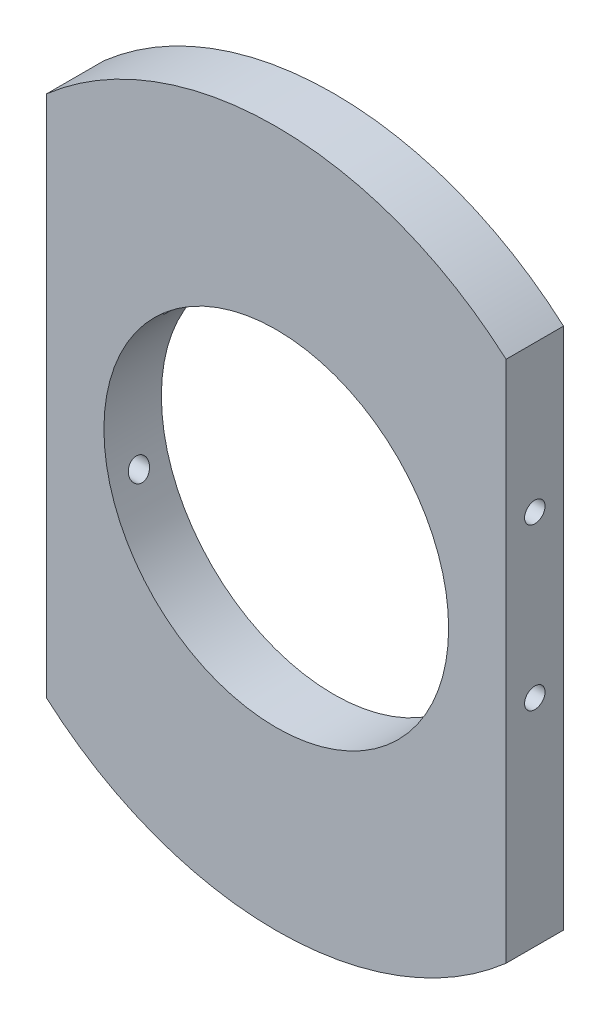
ISO-10303-21;
HEADER;
FILE_DESCRIPTION(('STEP AP214'),'2;1');
FILE_NAME('part.step','',(''),(''),'','','');
FILE_SCHEMA(('AUTOMOTIVE_DESIGN { 1 0 10303 214 1 1 1 1 }'));
ENDSEC;
DATA;
#1=APPLICATION_CONTEXT('core data for automotive mechanical design processes');
#2=APPLICATION_PROTOCOL_DEFINITION('international standard','automotive_design',2000,#1);
#3=PRODUCT_CONTEXT('',#1,'mechanical');
#4=PRODUCT('Part','Part','',(#3));
#5=PRODUCT_RELATED_PRODUCT_CATEGORY('part','',(#4));
#6=PRODUCT_DEFINITION_FORMATION('','',#4);
#7=PRODUCT_DEFINITION_CONTEXT('part definition',#1,'design');
#8=PRODUCT_DEFINITION('design','',#6,#7);
#9=PRODUCT_DEFINITION_SHAPE('','',#8);
#10=(LENGTH_UNIT() NAMED_UNIT(*) SI_UNIT(.MILLI.,.METRE.));
#11=(NAMED_UNIT(*) PLANE_ANGLE_UNIT() SI_UNIT($,.RADIAN.));
#12=(NAMED_UNIT(*) SI_UNIT($,.STERADIAN.) SOLID_ANGLE_UNIT());
#13=UNCERTAINTY_MEASURE_WITH_UNIT(LENGTH_MEASURE(1.E-05),#10,'distance_accuracy_value','');
#14=(GEOMETRIC_REPRESENTATION_CONTEXT(3) GLOBAL_UNCERTAINTY_ASSIGNED_CONTEXT((#13)) GLOBAL_UNIT_ASSIGNED_CONTEXT((#10,
#11,#12)) REPRESENTATION_CONTEXT('',''));
#15=CARTESIAN_POINT('',(0.,0.,0.));
#16=DIRECTION('',(0.,0.,1.));
#17=DIRECTION('',(1.,0.,0.));
#18=AXIS2_PLACEMENT_3D('',#15,#16,#17);
#19=CARTESIAN_POINT('',(0.,0.,6.35));
#20=DIRECTION('',(0.,0.,-1.));
#21=DIRECTION('',(-1.,0.,0.));
#22=AXIS2_PLACEMENT_3D('',#19,#20,#21);
#23=CYLINDRICAL_SURFACE('',#22,38.481);
#24=DIRECTION('',(0.,0.,-1.));
#25=VECTOR('',#24,1.);
#26=CARTESIAN_POINT('',(-25.4,28.9072198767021,6.35));
#27=LINE('',#26,#25);
#28=CARTESIAN_POINT('',(-25.4,28.9072198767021,6.35));
#29=VERTEX_POINT('',#28);
#30=CARTESIAN_POINT('',(-25.4,28.9072198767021,0.));
#31=VERTEX_POINT('',#30);
#32=EDGE_CURVE('E135',#29,#31,#27,.T.);
#33=ORIENTED_EDGE('',*,*,#32,.F.);
#34=CARTESIAN_POINT('',(0.,0.,6.35));
#35=DIRECTION('',(0.,0.,1.));
#36=DIRECTION('',(1.,0.,0.));
#37=AXIS2_PLACEMENT_3D('',#34,#35,#36);
#38=CIRCLE('',#37,38.481);
#39=CARTESIAN_POINT('',(25.4,28.9072198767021,6.35));
#40=VERTEX_POINT('',#39);
#41=EDGE_CURVE('E142',#40,#29,#38,.T.);
#42=ORIENTED_EDGE('',*,*,#41,.F.);
#43=DIRECTION('',(0.,0.,-1.));
#44=VECTOR('',#43,1.);
#45=CARTESIAN_POINT('',(25.4,28.9072198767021,6.35));
#46=LINE('',#45,#44);
#47=CARTESIAN_POINT('',(25.4,28.9072198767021,0.));
#48=VERTEX_POINT('',#47);
#49=EDGE_CURVE('E210',#48,#40,#46,.F.);
#50=ORIENTED_EDGE('',*,*,#49,.F.);
#51=CARTESIAN_POINT('',(0.,0.,0.));
#52=DIRECTION('',(0.,0.,1.));
#53=DIRECTION('',(1.,0.,0.));
#54=AXIS2_PLACEMENT_3D('',#51,#52,#53);
#55=CIRCLE('',#54,38.481);
#56=EDGE_CURVE('E147',#48,#31,#55,.T.);
#57=ORIENTED_EDGE('',*,*,#56,.T.);
#58=EDGE_LOOP('',(#33,#42,#50,#57));
#59=FACE_BOUND('',#58,.T.);
#60=ADVANCED_FACE('F46',(#59),#23,.T.);
#61=DIRECTION('',(0.,0.,-1.));
#62=VECTOR('',#61,1.);
#63=CARTESIAN_POINT('',(-25.4,-28.9072198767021,6.35));
#64=LINE('',#63,#62);
#65=CARTESIAN_POINT('',(-25.4,-28.9072198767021,0.));
#66=VERTEX_POINT('',#65);
#67=CARTESIAN_POINT('',(-25.4,-28.9072198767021,6.35));
#68=VERTEX_POINT('',#67);
#69=EDGE_CURVE('E139',#66,#68,#64,.F.);
#70=ORIENTED_EDGE('',*,*,#69,.F.);
#71=CARTESIAN_POINT('',(25.4,-28.9072198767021,0.));
#72=VERTEX_POINT('',#71);
#73=EDGE_CURVE('E137',#66,#72,#55,.T.);
#74=ORIENTED_EDGE('',*,*,#73,.T.);
#75=DIRECTION('',(0.,0.,-1.));
#76=VECTOR('',#75,1.);
#77=CARTESIAN_POINT('',(25.4,-28.9072198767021,6.35));
#78=LINE('',#77,#76);
#79=CARTESIAN_POINT('',(25.4,-28.9072198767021,6.35));
#80=VERTEX_POINT('',#79);
#81=EDGE_CURVE('E212',#80,#72,#78,.T.);
#82=ORIENTED_EDGE('',*,*,#81,.F.);
#83=EDGE_CURVE('E146',#68,#80,#38,.T.);
#84=ORIENTED_EDGE('',*,*,#83,.F.);
#85=EDGE_LOOP('',(#70,#74,#82,#84));
#86=FACE_BOUND('',#85,.T.);
#87=ADVANCED_FACE('F189',(#86),#23,.T.);
#88=CARTESIAN_POINT('',(0.,0.,6.35));
#89=DIRECTION('',(0.,0.,1.));
#90=DIRECTION('',(1.,0.,0.));
#91=AXIS2_PLACEMENT_3D('',#88,#89,#90);
#92=PLANE('',#91);
#93=CARTESIAN_POINT('',(0.,0.,6.35));
#94=DIRECTION('',(0.,0.,1.));
#95=DIRECTION('',(1.,0.,0.));
#96=AXIS2_PLACEMENT_3D('',#93,#94,#95);
#97=CIRCLE('',#96,19.05);
#98=CARTESIAN_POINT('',(19.05,0.,6.35));
#99=VERTEX_POINT('',#98);
#100=EDGE_CURVE('E133',#99,#99,#97,.T.);
#101=ORIENTED_EDGE('',*,*,#100,.F.);
#102=EDGE_LOOP('',(#101));
#103=FACE_BOUND('',#102,.T.);
#104=ORIENTED_EDGE('',*,*,#41,.T.);
#105=DIRECTION('',(0.,-1.,0.));
#106=VECTOR('',#105,1.);
#107=CARTESIAN_POINT('',(-25.4,41.1230349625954,6.35));
#108=LINE('',#107,#106);
#109=EDGE_CURVE('E158',#29,#68,#108,.T.);
#110=ORIENTED_EDGE('',*,*,#109,.T.);
#111=ORIENTED_EDGE('',*,*,#83,.T.);
#112=DIRECTION('',(0.,1.,0.));
#113=VECTOR('',#112,1.);
#114=CARTESIAN_POINT('',(25.4,41.1230349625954,6.35));
#115=LINE('',#114,#113);
#116=EDGE_CURVE('E207',#80,#40,#115,.T.);
#117=ORIENTED_EDGE('',*,*,#116,.T.);
#118=EDGE_LOOP('',(#104,#110,#111,#117));
#119=FACE_BOUND('',#118,.T.);
#120=ADVANCED_FACE('F194',(#103,#119),#92,.T.);
#121=CARTESIAN_POINT('',(0.,0.,0.));
#122=DIRECTION('',(0.,0.,1.));
#123=DIRECTION('',(1.,0.,0.));
#124=AXIS2_PLACEMENT_3D('',#121,#122,#123);
#125=PLANE('',#124);
#126=CARTESIAN_POINT('',(0.,0.,0.));
#127=DIRECTION('',(0.,0.,1.));
#128=DIRECTION('',(1.,0.,0.));
#129=AXIS2_PLACEMENT_3D('',#126,#127,#128);
#130=CIRCLE('',#129,19.05);
#131=CARTESIAN_POINT('',(19.05,0.,0.));
#132=VERTEX_POINT('',#131);
#133=EDGE_CURVE('E130',#132,#132,#130,.T.);
#134=ORIENTED_EDGE('',*,*,#133,.T.);
#135=EDGE_LOOP('',(#134));
#136=FACE_BOUND('',#135,.T.);
#137=DIRECTION('',(0.,-1.,0.));
#138=VECTOR('',#137,1.);
#139=CARTESIAN_POINT('',(-25.4,0.,0.));
#140=LINE('',#139,#138);
#141=EDGE_CURVE('E151',#31,#66,#140,.T.);
#142=ORIENTED_EDGE('',*,*,#141,.F.);
#143=ORIENTED_EDGE('',*,*,#56,.F.);
#144=DIRECTION('',(0.,1.,0.));
#145=VECTOR('',#144,1.);
#146=CARTESIAN_POINT('',(25.4,0.,0.));
#147=LINE('',#146,#145);
#148=EDGE_CURVE('E145',#72,#48,#147,.T.);
#149=ORIENTED_EDGE('',*,*,#148,.F.);
#150=ORIENTED_EDGE('',*,*,#73,.F.);
#151=EDGE_LOOP('',(#142,#143,#149,#150));
#152=FACE_BOUND('',#151,.T.);
#153=ADVANCED_FACE('F114',(#136,#152),#125,.F.);
#154=CARTESIAN_POINT('',(0.,0.,0.));
#155=DIRECTION('',(0.,0.,1.));
#156=DIRECTION('',(1.,0.,0.));
#157=AXIS2_PLACEMENT_3D('',#154,#155,#156);
#158=CYLINDRICAL_SURFACE('',#157,19.05);
#159=CARTESIAN_POINT('',(-14.0381152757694,12.8776480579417,4.40590960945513));
#160=CARTESIAN_POINT('',(-14.0115220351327,12.9066407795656,4.35694935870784));
#161=CARTESIAN_POINT('',(-13.9853492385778,12.9349887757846,4.30734700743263));
#162=CARTESIAN_POINT('',(-13.9341963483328,12.9900758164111,4.20641559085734));
#163=CARTESIAN_POINT('',(-13.9092203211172,13.0168094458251,4.1550815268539));
#164=CARTESIAN_POINT('',(-13.8602414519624,13.068952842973,4.04893507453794));
#165=CARTESIAN_POINT('',(-13.8362926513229,13.094296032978,3.99406420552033));
#166=CARTESIAN_POINT('',(-13.7910294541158,13.1419589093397,3.88205226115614));
#167=CARTESIAN_POINT('',(-13.7697117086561,13.1642824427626,3.82491419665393));
#168=CARTESIAN_POINT('',(-13.7280459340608,13.2077356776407,3.6996468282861));
#169=CARTESIAN_POINT('',(-13.7082554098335,13.2282564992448,3.63110149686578));
#170=CARTESIAN_POINT('',(-13.6840356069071,13.2532941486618,3.52596408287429));
#171=CARTESIAN_POINT('',(-13.6768907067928,13.2606650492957,3.49067380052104));
#172=CARTESIAN_POINT('',(-13.6646901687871,13.273236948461,3.41936155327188));
#173=CARTESIAN_POINT('',(-13.6596333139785,13.2784392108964,3.38334002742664));
#174=CARTESIAN_POINT('',(-13.6518110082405,13.2864814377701,3.31015540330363));
#175=CARTESIAN_POINT('',(-13.6490857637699,13.2892799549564,3.27298330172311));
#176=CARTESIAN_POINT('',(-13.6462484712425,13.2921934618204,3.19843473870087));
#177=CARTESIAN_POINT('',(-13.6461361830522,13.2923086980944,3.16105829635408));
#178=CARTESIAN_POINT('',(-13.6485347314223,13.289845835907,3.08641688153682));
#179=CARTESIAN_POINT('',(-13.6510500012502,13.2872631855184,3.04915220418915));
#180=CARTESIAN_POINT('',(-13.6585439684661,13.2795596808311,2.97514450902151));
#181=CARTESIAN_POINT('',(-13.6635231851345,13.2744382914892,2.93840160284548));
#182=CARTESIAN_POINT('',(-13.6845438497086,13.2527814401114,2.8125654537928));
#183=CARTESIAN_POINT('',(-13.7061233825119,13.2304972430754,2.72534727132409));
#184=CARTESIAN_POINT('',(-13.7448529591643,13.1902187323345,2.59868775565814));
#185=CARTESIAN_POINT('',(-13.7588912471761,13.1755787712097,2.55700588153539));
#186=CARTESIAN_POINT('',(-13.7886272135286,13.1444559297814,2.47493713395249));
#187=CARTESIAN_POINT('',(-13.8043243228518,13.1279736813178,2.43454982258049));
#188=CARTESIAN_POINT('',(-13.8370486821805,13.0934774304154,2.35483896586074));
#189=CARTESIAN_POINT('',(-13.8540798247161,13.0754589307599,2.31551902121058));
#190=CARTESIAN_POINT('',(-13.8891502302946,13.0382000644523,2.23791673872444));
#191=CARTESIAN_POINT('',(-13.9071896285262,13.0189595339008,2.19963454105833));
#192=CARTESIAN_POINT('',(-13.9437145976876,12.9798314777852,2.12469416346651));
#193=CARTESIAN_POINT('',(-13.9621856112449,12.9599626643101,2.08801901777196));
#194=CARTESIAN_POINT('',(-13.9997314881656,12.91939575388,2.01547825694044));
#195=CARTESIAN_POINT('',(-14.0188059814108,12.8986981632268,1.97961216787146));
#196=CARTESIAN_POINT('',(-14.0381152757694,12.8776480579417,1.94409039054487));
#197=B_SPLINE_CURVE_WITH_KNOTS('',3,(#159,#160,#161,#162,#163,#164,#165,#166,#167,#168,#169,
#170,#171,#172,#173,#174,#175,#176,#177,#178,#179,#180,#181,#182,#183,#184,#185,#186,#187,#188,
#189,#190,#191,#192,#193,#194,#195,#196),.UNSPECIFIED.,.F.,.F.,(4,2,2,2,2,2,2,2,2,2,2,2,2,2,2,2,
2,2,4),(0.,0.188453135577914,0.377506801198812,0.572411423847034,0.767065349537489,
0.989080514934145,1.09923216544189,1.20931952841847,1.32126904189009,1.433208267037,
1.54533666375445,1.65748870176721,1.93335285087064,2.07239046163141,2.21138053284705,
2.35079245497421,2.49022311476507,2.62705816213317,2.76381085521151),.UNSPECIFIED.);
#198=CARTESIAN_POINT('',(-13.97,12.9515095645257,4.27696235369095));
#199=VERTEX_POINT('',#198);
#200=CARTESIAN_POINT('',(-13.9699999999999,12.9515095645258,2.07303764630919));
#201=VERTEX_POINT('',#200);
#202=EDGE_CURVE('E59',#199,#201,#197,.T.);
#203=ORIENTED_EDGE('',*,*,#202,.T.);
#204=CARTESIAN_POINT('',(-13.97,12.9515095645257,2.07303764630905));
#205=CARTESIAN_POINT('',(-14.0019047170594,12.9170967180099,2.06518948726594));
#206=CARTESIAN_POINT('',(-14.033853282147,12.8823796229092,2.05895562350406));
#207=CARTESIAN_POINT('',(-14.0977126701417,12.8124641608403,2.04975467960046));
#208=CARTESIAN_POINT('',(-14.1296234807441,12.7772656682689,2.04678846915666));
#209=CARTESIAN_POINT('',(-14.2254283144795,12.6707857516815,2.04283949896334));
#210=CARTESIAN_POINT('',(-14.2890479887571,12.5989936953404,2.04689203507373));
#211=CARTESIAN_POINT('',(-14.4141489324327,12.4556762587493,2.06904003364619));
#212=CARTESIAN_POINT('',(-14.4756297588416,12.3841509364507,2.08713838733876));
#213=CARTESIAN_POINT('',(-14.5948244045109,12.2434493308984,2.13831199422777));
#214=CARTESIAN_POINT('',(-14.6525461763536,12.1742682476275,2.17135437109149));
#215=CARTESIAN_POINT('',(-14.7499789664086,12.0559169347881,2.24418137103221));
#216=CARTESIAN_POINT('',(-14.7908279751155,12.0057357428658,2.280797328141));
#217=CARTESIAN_POINT('',(-14.8678605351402,11.9102044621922,2.36395227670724));
#218=CARTESIAN_POINT('',(-14.9040493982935,11.8648488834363,2.41047980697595));
#219=CARTESIAN_POINT('',(-14.9641101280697,11.7889697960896,2.50379277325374));
#220=CARTESIAN_POINT('',(-14.9890219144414,11.7572549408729,2.54893548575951));
#221=CARTESIAN_POINT('',(-15.0337930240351,11.6999525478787,2.64526625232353));
#222=CARTESIAN_POINT('',(-15.0536541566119,11.6743628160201,2.69645213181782));
#223=CARTESIAN_POINT('',(-15.0874646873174,11.6306356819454,2.80426510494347));
#224=CARTESIAN_POINT('',(-15.1013689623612,11.6125551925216,2.86092987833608));
#225=CARTESIAN_POINT('',(-15.1221652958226,11.5854614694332,2.97761948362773));
#226=CARTESIAN_POINT('',(-15.1290631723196,11.5764407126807,3.03764148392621));
#227=CARTESIAN_POINT('',(-15.134970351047,11.5687159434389,3.15095023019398));
#228=CARTESIAN_POINT('',(-15.1348776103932,11.5688375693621,3.20411394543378));
#229=CARTESIAN_POINT('',(-15.1290201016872,11.5764966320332,3.30957630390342));
#230=CARTESIAN_POINT('',(-15.1232566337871,11.5840323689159,3.3618751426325));
#231=CARTESIAN_POINT('',(-15.1067137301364,11.6055966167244,3.46201979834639));
#232=CARTESIAN_POINT('',(-15.0961439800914,11.6193535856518,3.50996004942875));
#233=CARTESIAN_POINT('',(-15.0705495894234,11.6525307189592,3.60255942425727));
#234=CARTESIAN_POINT('',(-15.0555242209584,11.6719518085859,3.64721801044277));
#235=CARTESIAN_POINT('',(-15.0201923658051,11.7173892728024,3.7360189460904));
#236=CARTESIAN_POINT('',(-14.9995532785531,11.7438165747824,3.77981706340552));
#237=CARTESIAN_POINT('',(-14.9544702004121,11.8011717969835,3.86217528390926));
#238=CARTESIAN_POINT('',(-14.9300237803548,11.8321025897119,3.90073201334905));
#239=CARTESIAN_POINT('',(-14.8666988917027,11.9116467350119,3.98796455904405));
#240=CARTESIAN_POINT('',(-14.8261628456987,11.9621065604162,4.03376519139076));
#241=CARTESIAN_POINT('',(-14.7403613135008,12.0676801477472,4.11424146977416));
#242=CARTESIAN_POINT('',(-14.6950868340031,12.1228027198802,4.14889543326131));
#243=CARTESIAN_POINT('',(-14.5885181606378,12.2509711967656,4.21541962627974));
#244=CARTESIAN_POINT('',(-14.5261921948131,12.3248477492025,4.24402977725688));
#245=CARTESIAN_POINT('',(-14.3981920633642,12.4741440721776,4.28521356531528));
#246=CARTESIAN_POINT('',(-14.3325145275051,12.5495653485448,4.29777071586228));
#247=CARTESIAN_POINT('',(-14.21707731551,12.6800106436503,4.3064832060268));
#248=CARTESIAN_POINT('',(-14.1676889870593,12.7351669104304,4.30609145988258));
#249=CARTESIAN_POINT('',(-14.0688267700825,12.8443009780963,4.29737339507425));
#250=CARTESIAN_POINT('',(-14.0193543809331,12.8982831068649,4.28908446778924));
#251=CARTESIAN_POINT('',(-13.97,12.9515095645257,4.27696235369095));
#252=B_SPLINE_CURVE_WITH_KNOTS('',3,(#204,#205,#206,#207,#208,#209,#210,#211,#212,#213,#214,
#215,#216,#217,#218,#219,#220,#221,#222,#223,#224,#225,#226,#227,#228,#229,#230,#231,#232,#233,
#234,#235,#236,#237,#238,#239,#240,#241,#242,#243,#244,#245,#246,#247,#248,#249,#250,#251),
.UNSPECIFIED.,.F.,.F.,(4,2,2,2,2,2,2,2,2,2,2,2,2,2,2,2,2,2,2,2,2,2,2,4),(0.,0.14267393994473,
0.28538584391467,0.572347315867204,0.859367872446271,1.14576004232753,1.36799413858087,
1.58997263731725,1.77085201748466,1.95166650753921,2.13382743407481,2.31583697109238,
2.47451258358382,2.63315182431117,2.78545055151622,2.93777417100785,3.10261969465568,
3.2675708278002,3.50414236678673,3.74117134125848,4.04200157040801,4.34314050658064,
4.56483978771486,4.78549456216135),.UNSPECIFIED.);
#253=EDGE_CURVE('E12',#201,#199,#252,.T.);
#254=ORIENTED_EDGE('',*,*,#253,.T.);
#255=EDGE_LOOP('',(#203,#254));
#256=FACE_BOUND('',#255,.T.);
#257=CARTESIAN_POINT('',(-18.3601770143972,-5.08,4.30529999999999));
#258=CARTESIAN_POINT('',(-18.3780374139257,-5.01544704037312,4.30529752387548));
#259=CARTESIAN_POINT('',(-18.3955663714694,-4.95075728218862,4.29975522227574));
#260=CARTESIAN_POINT('',(-18.4294908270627,-4.8229401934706,4.27759358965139));
#261=CARTESIAN_POINT('',(-18.4458851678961,-4.75981449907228,4.26096312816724));
#262=CARTESIAN_POINT('',(-18.4771472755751,-4.63697618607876,4.21690526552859));
#263=CARTESIAN_POINT('',(-18.4920139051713,-4.57726612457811,4.18946989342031));
#264=CARTESIAN_POINT('',(-18.5198775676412,-4.46319235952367,4.12443925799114));
#265=CARTESIAN_POINT('',(-18.5328751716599,-4.40882702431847,4.08684710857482));
#266=CARTESIAN_POINT('',(-18.5564879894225,-4.30834805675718,4.00343182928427));
#267=CARTESIAN_POINT('',(-18.5671499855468,-4.26207706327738,3.95781159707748));
#268=CARTESIAN_POINT('',(-18.5862827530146,-4.17785396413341,3.85904732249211));
#269=CARTESIAN_POINT('',(-18.5947537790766,-4.13990089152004,3.80590415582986));
#270=CARTESIAN_POINT('',(-18.6091883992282,-4.07451856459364,3.69519614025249));
#271=CARTESIAN_POINT('',(-18.6152147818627,-4.0468276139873,3.63779394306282));
#272=CARTESIAN_POINT('',(-18.6250242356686,-4.00143915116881,3.51898676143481));
#273=CARTESIAN_POINT('',(-18.6288075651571,-3.9837404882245,3.45758223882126));
#274=CARTESIAN_POINT('',(-18.6340493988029,-3.95914884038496,3.33370442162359));
#275=CARTESIAN_POINT('',(-18.6355485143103,-3.95206713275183,3.27127024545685));
#276=CARTESIAN_POINT('',(-18.6363393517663,-3.94833633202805,3.14607853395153));
#277=CARTESIAN_POINT('',(-18.6356311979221,-3.95168665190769,3.08332101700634));
#278=CARTESIAN_POINT('',(-18.6320255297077,-3.96865185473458,2.95971167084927));
#279=CARTESIAN_POINT('',(-18.6291429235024,-3.98219684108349,2.89884979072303));
#280=CARTESIAN_POINT('',(-18.6212298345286,-4.01903615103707,2.78030196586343));
#281=CARTESIAN_POINT('',(-18.6161993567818,-4.0423304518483,2.72261601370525));
#282=CARTESIAN_POINT('',(-18.6040142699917,-4.09804408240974,2.61179282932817));
#283=CARTESIAN_POINT('',(-18.5968513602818,-4.13049904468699,2.55867443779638));
#284=CARTESIAN_POINT('',(-18.5804902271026,-4.20348394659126,2.4586687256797));
#285=CARTESIAN_POINT('',(-18.5712919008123,-4.24401429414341,2.41178172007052));
#286=CARTESIAN_POINT('',(-18.5508340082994,-4.33256825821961,2.32480501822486));
#287=CARTESIAN_POINT('',(-18.5395462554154,-4.38069282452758,2.28482479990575));
#288=CARTESIAN_POINT('',(-18.5151823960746,-4.48255063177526,2.21349087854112));
#289=CARTESIAN_POINT('',(-18.5021060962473,-4.53628447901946,2.18213810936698));
#290=CARTESIAN_POINT('',(-18.474061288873,-4.6491957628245,2.12810065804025));
#291=CARTESIAN_POINT('',(-18.4590542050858,-4.70847446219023,2.10564770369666));
#292=CARTESIAN_POINT('',(-18.4277286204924,-4.82962035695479,2.0709801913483));
#293=CARTESIAN_POINT('',(-18.4114099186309,-4.8914879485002,2.05876720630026));
#294=CARTESIAN_POINT('',(-18.3773422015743,-5.01798837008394,2.04455665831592));
#295=CARTESIAN_POINT('',(-18.3595651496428,-5.08264885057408,2.04287210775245));
#296=CARTESIAN_POINT('',(-18.3234983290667,-5.21117715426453,2.05049257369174));
#297=CARTESIAN_POINT('',(-18.3052084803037,-5.27504485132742,2.05979931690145));
#298=CARTESIAN_POINT('',(-18.268236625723,-5.40171098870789,2.08945583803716));
#299=CARTESIAN_POINT('',(-18.2495551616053,-5.46445207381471,2.11005195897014));
#300=CARTESIAN_POINT('',(-18.2128506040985,-5.5855690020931,2.16192618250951));
#301=CARTESIAN_POINT('',(-18.1948275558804,-5.64394454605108,2.19320501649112));
#302=CARTESIAN_POINT('',(-18.1601355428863,-5.75459299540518,2.26567438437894));
#303=CARTESIAN_POINT('',(-18.1434657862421,-5.80686947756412,2.30685906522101));
#304=CARTESIAN_POINT('',(-18.1121885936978,-5.90370375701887,2.39813789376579));
#305=CARTESIAN_POINT('',(-18.0975808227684,-5.94826280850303,2.44823059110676));
#306=CARTESIAN_POINT('',(-18.0715802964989,-6.02678564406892,2.55421000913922));
#307=CARTESIAN_POINT('',(-18.0600974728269,-6.06105014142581,2.60985145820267));
#308=CARTESIAN_POINT('',(-18.0403310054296,-6.11963389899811,2.72666525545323));
#309=CARTESIAN_POINT('',(-18.0320462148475,-6.14395672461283,2.78783561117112));
#310=CARTESIAN_POINT('',(-18.0194814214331,-6.18070781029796,2.91058858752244));
#311=CARTESIAN_POINT('',(-18.0150177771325,-6.19368224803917,2.97198907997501));
#312=CARTESIAN_POINT('',(-18.0096449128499,-6.20928828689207,3.09623877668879));
#313=CARTESIAN_POINT('',(-18.0087347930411,-6.21192250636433,3.15908761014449));
#314=CARTESIAN_POINT('',(-18.0104863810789,-6.20684177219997,3.28202385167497));
#315=CARTESIAN_POINT('',(-18.0130200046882,-6.19949793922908,3.3421288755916));
#316=CARTESIAN_POINT('',(-18.0212992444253,-6.17538938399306,3.46018352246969));
#317=CARTESIAN_POINT('',(-18.0270448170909,-6.158624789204,3.51813317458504));
#318=CARTESIAN_POINT('',(-18.0414822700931,-6.11620122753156,3.63050524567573));
#319=CARTESIAN_POINT('',(-18.0501840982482,-6.09051222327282,3.68491500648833));
#320=CARTESIAN_POINT('',(-18.0701206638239,-6.03110416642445,3.78863895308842));
#321=CARTESIAN_POINT('',(-18.081355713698,-5.99738412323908,3.83795250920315));
#322=CARTESIAN_POINT('',(-18.1063597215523,-5.92147712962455,3.93216183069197));
#323=CARTESIAN_POINT('',(-18.120210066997,-5.87901247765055,3.97681201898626));
#324=CARTESIAN_POINT('',(-18.1495723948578,-5.78773000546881,4.0584296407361));
#325=CARTESIAN_POINT('',(-18.1650851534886,-5.73890921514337,4.09539346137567));
#326=CARTESIAN_POINT('',(-18.1980133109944,-5.63364885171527,4.16249138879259));
#327=CARTESIAN_POINT('',(-18.2154850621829,-5.57695037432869,4.19219153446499));
#328=CARTESIAN_POINT('',(-18.2510107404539,-5.45956555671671,4.24156281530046));
#329=CARTESIAN_POINT('',(-18.2690641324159,-5.39888283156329,4.26124290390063));
#330=CARTESIAN_POINT('',(-18.2993961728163,-5.29495314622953,4.28551430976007));
#331=CARTESIAN_POINT('',(-18.311673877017,-5.25234137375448,4.29291887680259));
#332=CARTESIAN_POINT('',(-18.3360764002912,-5.16650691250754,4.3028126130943));
#333=CARTESIAN_POINT('',(-18.3482012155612,-5.1232842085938,4.30530166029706));
#334=CARTESIAN_POINT('',(-18.3601770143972,-5.08,4.30529999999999));
#335=B_SPLINE_CURVE_WITH_KNOTS('',3,(#257,#258,#259,#260,#261,#262,#263,#264,#265,#266,#267,
#268,#269,#270,#271,#272,#273,#274,#275,#276,#277,#278,#279,#280,#281,#282,#283,#284,#285,#286,
#287,#288,#289,#290,#291,#292,#293,#294,#295,#296,#297,#298,#299,#300,#301,#302,#303,#304,#305,
#306,#307,#308,#309,#310,#311,#312,#313,#314,#315,#316,#317,#318,#319,#320,#321,#322,#323,#324,
#325,#326,#327,#328,#329,#330,#331,#332,#333,#334),.UNSPECIFIED.,.T.,.F.,(4,2,2,2,2,2,2,2,2,2,2,
2,2,2,2,2,2,2,2,2,2,2,2,2,2,2,2,2,2,2,2,2,2,2,2,2,2,2,4),(0.,0.200776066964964,
0.401753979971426,0.602880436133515,0.803945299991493,1.00051317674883,1.19705819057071,
1.38817506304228,1.57926992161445,1.76692592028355,1.95457135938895,2.14094185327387,
2.3273119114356,2.51441713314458,2.70153180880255,2.89138392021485,3.0812565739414,
3.27579115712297,3.47035561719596,3.67067803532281,3.87103192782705,4.07594256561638,
4.28086723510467,4.48567111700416,4.69044168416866,4.88846567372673,5.08641858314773,
5.27421658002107,5.46196701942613,5.64292213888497,5.82387480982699,6.00544252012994,
6.18703263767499,6.37566687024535,6.56438956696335,6.76254957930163,6.96053221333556,
7.09515373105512,7.22977859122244),.UNSPECIFIED.);
#336=CARTESIAN_POINT('',(-18.3601770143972,-5.08,4.30529999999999));
#337=VERTEX_POINT('',#336);
#338=EDGE_CURVE('E118',#337,#337,#335,.T.);
#339=ORIENTED_EDGE('',*,*,#338,.T.);
#340=EDGE_LOOP('',(#339));
#341=FACE_BOUND('',#340,.T.);
#342=CARTESIAN_POINT('',(14.0381152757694,12.8776480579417,1.94409039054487));
#343=CARTESIAN_POINT('',(14.0115220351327,12.9066407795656,1.99305064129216));
#344=CARTESIAN_POINT('',(13.9853492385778,12.9349887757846,2.04265299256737));
#345=CARTESIAN_POINT('',(13.9341963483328,12.9900758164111,2.14358440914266));
#346=CARTESIAN_POINT('',(13.9092203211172,13.0168094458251,2.1949184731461));
#347=CARTESIAN_POINT('',(13.8602414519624,13.068952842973,2.30106492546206));
#348=CARTESIAN_POINT('',(13.8362926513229,13.094296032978,2.35593579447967));
#349=CARTESIAN_POINT('',(13.7910294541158,13.1419589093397,2.46794773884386));
#350=CARTESIAN_POINT('',(13.7697117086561,13.1642824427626,2.52508580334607));
#351=CARTESIAN_POINT('',(13.7280459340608,13.2077356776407,2.6503531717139));
#352=CARTESIAN_POINT('',(13.7082554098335,13.2282564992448,2.71889850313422));
#353=CARTESIAN_POINT('',(13.6840356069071,13.2532941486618,2.82403591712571));
#354=CARTESIAN_POINT('',(13.6768907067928,13.2606650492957,2.85932619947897));
#355=CARTESIAN_POINT('',(13.6646901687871,13.273236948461,2.93063844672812));
#356=CARTESIAN_POINT('',(13.6596333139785,13.2784392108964,2.96665997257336));
#357=CARTESIAN_POINT('',(13.6518110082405,13.2864814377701,3.03984459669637));
#358=CARTESIAN_POINT('',(13.6490857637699,13.2892799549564,3.0770166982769));
#359=CARTESIAN_POINT('',(13.6462484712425,13.2921934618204,3.15156526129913));
#360=CARTESIAN_POINT('',(13.6461361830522,13.2923086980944,3.18894170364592));
#361=CARTESIAN_POINT('',(13.6485347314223,13.289845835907,3.26358311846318));
#362=CARTESIAN_POINT('',(13.6510500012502,13.2872631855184,3.30084779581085));
#363=CARTESIAN_POINT('',(13.6585439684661,13.2795596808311,3.37485549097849));
#364=CARTESIAN_POINT('',(13.6635231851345,13.2744382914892,3.41159839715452));
#365=CARTESIAN_POINT('',(13.6845438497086,13.2527814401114,3.5374345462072));
#366=CARTESIAN_POINT('',(13.7061233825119,13.2304972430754,3.62465272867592));
#367=CARTESIAN_POINT('',(13.7448529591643,13.1902187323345,3.75131224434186));
#368=CARTESIAN_POINT('',(13.7588912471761,13.1755787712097,3.79299411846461));
#369=CARTESIAN_POINT('',(13.7886272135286,13.1444559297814,3.87506286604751));
#370=CARTESIAN_POINT('',(13.8043243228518,13.1279736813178,3.91545017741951));
#371=CARTESIAN_POINT('',(13.8370486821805,13.0934774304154,3.99516103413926));
#372=CARTESIAN_POINT('',(13.8540798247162,13.0754589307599,4.03448097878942));
#373=CARTESIAN_POINT('',(13.8891502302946,13.0382000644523,4.11208326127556));
#374=CARTESIAN_POINT('',(13.9071896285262,13.0189595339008,4.15036545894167));
#375=CARTESIAN_POINT('',(13.9437145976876,12.9798314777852,4.2253058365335));
#376=CARTESIAN_POINT('',(13.9621856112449,12.9599626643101,4.26198098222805));
#377=CARTESIAN_POINT('',(13.9997314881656,12.91939575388,4.33452174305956));
#378=CARTESIAN_POINT('',(14.0188059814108,12.8986981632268,4.37038783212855));
#379=CARTESIAN_POINT('',(14.0381152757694,12.8776480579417,4.40590960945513));
#380=B_SPLINE_CURVE_WITH_KNOTS('',3,(#342,#343,#344,#345,#346,#347,#348,#349,#350,#351,#352,
#353,#354,#355,#356,#357,#358,#359,#360,#361,#362,#363,#364,#365,#366,#367,#368,#369,#370,#371,
#372,#373,#374,#375,#376,#377,#378,#379),.UNSPECIFIED.,.F.,.F.,(4,2,2,2,2,2,2,2,2,2,2,2,2,2,2,2,
2,2,4),(0.,0.188453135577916,0.377506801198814,0.572411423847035,0.767065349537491,
0.989080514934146,1.09923216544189,1.20931952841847,1.32126904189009,1.433208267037,
1.54533666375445,1.65748870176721,1.93335285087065,2.07239046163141,2.21138053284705,
2.35079245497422,2.49022311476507,2.62705816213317,2.76381085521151),.UNSPECIFIED.);
#381=CARTESIAN_POINT('',(13.97,12.9515095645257,2.07303764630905));
#382=VERTEX_POINT('',#381);
#383=CARTESIAN_POINT('',(13.9699999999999,12.9515095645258,4.27696235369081));
#384=VERTEX_POINT('',#383);
#385=EDGE_CURVE('E122',#382,#384,#380,.T.);
#386=ORIENTED_EDGE('',*,*,#385,.T.);
#387=CARTESIAN_POINT('',(13.97,12.9515095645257,4.27696235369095));
#388=CARTESIAN_POINT('',(14.0019047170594,12.9170967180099,4.28481051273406));
#389=CARTESIAN_POINT('',(14.033853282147,12.8823796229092,4.29104437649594));
#390=CARTESIAN_POINT('',(14.0977126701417,12.8124641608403,4.30024532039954));
#391=CARTESIAN_POINT('',(14.1296234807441,12.7772656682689,4.30321153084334));
#392=CARTESIAN_POINT('',(14.2254283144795,12.6707857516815,4.30716050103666));
#393=CARTESIAN_POINT('',(14.2890479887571,12.5989936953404,4.30310796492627));
#394=CARTESIAN_POINT('',(14.4141489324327,12.4556762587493,4.28095996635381));
#395=CARTESIAN_POINT('',(14.4756297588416,12.3841509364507,4.26286161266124));
#396=CARTESIAN_POINT('',(14.5948244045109,12.2434493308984,4.21168800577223));
#397=CARTESIAN_POINT('',(14.6525461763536,12.1742682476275,4.17864562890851));
#398=CARTESIAN_POINT('',(14.7499789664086,12.0559169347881,4.10581862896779));
#399=CARTESIAN_POINT('',(14.7908279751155,12.0057357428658,4.069202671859));
#400=CARTESIAN_POINT('',(14.8678605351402,11.9102044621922,3.98604772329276));
#401=CARTESIAN_POINT('',(14.9040493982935,11.8648488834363,3.93952019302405));
#402=CARTESIAN_POINT('',(14.9641101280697,11.7889697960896,3.84620722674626));
#403=CARTESIAN_POINT('',(14.9890219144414,11.7572549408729,3.80106451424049));
#404=CARTESIAN_POINT('',(15.0337930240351,11.6999525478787,3.70473374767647));
#405=CARTESIAN_POINT('',(15.0536541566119,11.6743628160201,3.65354786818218));
#406=CARTESIAN_POINT('',(15.0874646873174,11.6306356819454,3.54573489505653));
#407=CARTESIAN_POINT('',(15.1013689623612,11.6125551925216,3.48907012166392));
#408=CARTESIAN_POINT('',(15.1221652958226,11.5854614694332,3.37238051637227));
#409=CARTESIAN_POINT('',(15.1290631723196,11.5764407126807,3.31235851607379));
#410=CARTESIAN_POINT('',(15.134970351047,11.5687159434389,3.19904976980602));
#411=CARTESIAN_POINT('',(15.1348776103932,11.5688375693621,3.14588605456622));
#412=CARTESIAN_POINT('',(15.1290201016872,11.5764966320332,3.04042369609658));
#413=CARTESIAN_POINT('',(15.1232566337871,11.5840323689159,2.9881248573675));
#414=CARTESIAN_POINT('',(15.1067137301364,11.6055966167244,2.88798020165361));
#415=CARTESIAN_POINT('',(15.0961439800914,11.6193535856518,2.84003995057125));
#416=CARTESIAN_POINT('',(15.0705495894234,11.6525307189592,2.74744057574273));
#417=CARTESIAN_POINT('',(15.0555242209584,11.6719518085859,2.70278198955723));
#418=CARTESIAN_POINT('',(15.0201923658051,11.7173892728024,2.6139810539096));
#419=CARTESIAN_POINT('',(14.9995532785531,11.7438165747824,2.57018293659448));
#420=CARTESIAN_POINT('',(14.9544702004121,11.8011717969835,2.48782471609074));
#421=CARTESIAN_POINT('',(14.9300237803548,11.8321025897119,2.44926798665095));
#422=CARTESIAN_POINT('',(14.8666988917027,11.9116467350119,2.36203544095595));
#423=CARTESIAN_POINT('',(14.8261628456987,11.9621065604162,2.31623480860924));
#424=CARTESIAN_POINT('',(14.7403613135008,12.0676801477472,2.23575853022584));
#425=CARTESIAN_POINT('',(14.6950868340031,12.1228027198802,2.20110456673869));
#426=CARTESIAN_POINT('',(14.5885181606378,12.2509711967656,2.13458037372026));
#427=CARTESIAN_POINT('',(14.5261921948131,12.3248477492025,2.10597022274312));
#428=CARTESIAN_POINT('',(14.3981920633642,12.4741440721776,2.06478643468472));
#429=CARTESIAN_POINT('',(14.3325145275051,12.5495653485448,2.05222928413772));
#430=CARTESIAN_POINT('',(14.21707731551,12.6800106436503,2.0435167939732));
#431=CARTESIAN_POINT('',(14.1676889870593,12.7351669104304,2.04390854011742));
#432=CARTESIAN_POINT('',(14.0688267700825,12.8443009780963,2.05262660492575));
#433=CARTESIAN_POINT('',(14.0193543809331,12.8982831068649,2.06091553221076));
#434=CARTESIAN_POINT('',(13.97,12.9515095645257,2.07303764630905));
#435=B_SPLINE_CURVE_WITH_KNOTS('',3,(#387,#388,#389,#390,#391,#392,#393,#394,#395,#396,#397,
#398,#399,#400,#401,#402,#403,#404,#405,#406,#407,#408,#409,#410,#411,#412,#413,#414,#415,#416,
#417,#418,#419,#420,#421,#422,#423,#424,#425,#426,#427,#428,#429,#430,#431,#432,#433,#434),
.UNSPECIFIED.,.F.,.F.,(4,2,2,2,2,2,2,2,2,2,2,2,2,2,2,2,2,2,2,2,2,2,2,4),(0.,0.14267393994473,
0.28538584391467,0.572347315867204,0.859367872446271,1.14576004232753,1.36799413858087,
1.58997263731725,1.77085201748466,1.95166650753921,2.13382743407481,2.31583697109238,
2.47451258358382,2.63315182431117,2.78545055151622,2.93777417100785,3.10261969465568,
3.2675708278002,3.50414236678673,3.74117134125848,4.04200157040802,4.34314050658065,
4.56483978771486,4.78549456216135),.UNSPECIFIED.);
#436=EDGE_CURVE('E104',#384,#382,#435,.T.);
#437=ORIENTED_EDGE('',*,*,#436,.T.);
#438=EDGE_LOOP('',(#386,#437));
#439=FACE_BOUND('',#438,.T.);
#440=CARTESIAN_POINT('',(18.3601770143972,-5.08,2.04470000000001));
#441=CARTESIAN_POINT('',(18.3780374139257,-5.01544704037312,2.04470247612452));
#442=CARTESIAN_POINT('',(18.3955663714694,-4.95075728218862,2.05024477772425));
#443=CARTESIAN_POINT('',(18.4294908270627,-4.8229401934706,2.07240641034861));
#444=CARTESIAN_POINT('',(18.4458851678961,-4.75981449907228,2.08903687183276));
#445=CARTESIAN_POINT('',(18.4771472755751,-4.63697618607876,2.13309473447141));
#446=CARTESIAN_POINT('',(18.4920139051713,-4.57726612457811,2.16053010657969));
#447=CARTESIAN_POINT('',(18.5198775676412,-4.46319235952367,2.22556074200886));
#448=CARTESIAN_POINT('',(18.5328751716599,-4.40882702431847,2.26315289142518));
#449=CARTESIAN_POINT('',(18.5564879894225,-4.30834805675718,2.34656817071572));
#450=CARTESIAN_POINT('',(18.5671499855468,-4.26207706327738,2.39218840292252));
#451=CARTESIAN_POINT('',(18.5862827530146,-4.17785396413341,2.49095267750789));
#452=CARTESIAN_POINT('',(18.5947537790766,-4.13990089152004,2.54409584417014));
#453=CARTESIAN_POINT('',(18.6091883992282,-4.07451856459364,2.65480385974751));
#454=CARTESIAN_POINT('',(18.6152147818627,-4.0468276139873,2.71220605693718));
#455=CARTESIAN_POINT('',(18.6250242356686,-4.00143915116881,2.83101323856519));
#456=CARTESIAN_POINT('',(18.6288075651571,-3.9837404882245,2.89241776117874));
#457=CARTESIAN_POINT('',(18.6340493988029,-3.95914884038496,3.01629557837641));
#458=CARTESIAN_POINT('',(18.6355485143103,-3.95206713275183,3.07872975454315));
#459=CARTESIAN_POINT('',(18.6363393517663,-3.94833633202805,3.20392146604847));
#460=CARTESIAN_POINT('',(18.6356311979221,-3.95168665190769,3.26667898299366));
#461=CARTESIAN_POINT('',(18.6320255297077,-3.96865185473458,3.39028832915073));
#462=CARTESIAN_POINT('',(18.6291429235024,-3.98219684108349,3.45115020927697));
#463=CARTESIAN_POINT('',(18.6212298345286,-4.01903615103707,3.56969803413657));
#464=CARTESIAN_POINT('',(18.6161993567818,-4.0423304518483,3.62738398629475));
#465=CARTESIAN_POINT('',(18.6040142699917,-4.09804408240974,3.73820717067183));
#466=CARTESIAN_POINT('',(18.5968513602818,-4.13049904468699,3.79132556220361));
#467=CARTESIAN_POINT('',(18.5804902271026,-4.20348394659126,3.8913312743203));
#468=CARTESIAN_POINT('',(18.5712919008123,-4.24401429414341,3.93821827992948));
#469=CARTESIAN_POINT('',(18.5508340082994,-4.33256825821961,4.02519498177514));
#470=CARTESIAN_POINT('',(18.5395462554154,-4.38069282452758,4.06517520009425));
#471=CARTESIAN_POINT('',(18.5151823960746,-4.48255063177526,4.13650912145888));
#472=CARTESIAN_POINT('',(18.5021060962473,-4.53628447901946,4.16786189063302));
#473=CARTESIAN_POINT('',(18.474061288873,-4.6491957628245,4.22189934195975));
#474=CARTESIAN_POINT('',(18.4590542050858,-4.70847446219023,4.24435229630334));
#475=CARTESIAN_POINT('',(18.4277286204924,-4.82962035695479,4.2790198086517));
#476=CARTESIAN_POINT('',(18.4114099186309,-4.8914879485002,4.29123279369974));
#477=CARTESIAN_POINT('',(18.3773422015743,-5.01798837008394,4.30544334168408));
#478=CARTESIAN_POINT('',(18.3595651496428,-5.08264885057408,4.30712789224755));
#479=CARTESIAN_POINT('',(18.3234983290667,-5.21117715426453,4.29950742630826));
#480=CARTESIAN_POINT('',(18.3052084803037,-5.27504485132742,4.29020068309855));
#481=CARTESIAN_POINT('',(18.268236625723,-5.40171098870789,4.26054416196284));
#482=CARTESIAN_POINT('',(18.2495551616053,-5.46445207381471,4.23994804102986));
#483=CARTESIAN_POINT('',(18.2128506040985,-5.5855690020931,4.18807381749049));
#484=CARTESIAN_POINT('',(18.1948275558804,-5.64394454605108,4.15679498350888));
#485=CARTESIAN_POINT('',(18.1601355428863,-5.75459299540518,4.08432561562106));
#486=CARTESIAN_POINT('',(18.1434657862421,-5.80686947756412,4.043140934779));
#487=CARTESIAN_POINT('',(18.1121885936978,-5.90370375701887,3.95186210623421));
#488=CARTESIAN_POINT('',(18.0975808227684,-5.94826280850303,3.90176940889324));
#489=CARTESIAN_POINT('',(18.0715802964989,-6.02678564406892,3.79578999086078));
#490=CARTESIAN_POINT('',(18.0600974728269,-6.06105014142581,3.74014854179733));
#491=CARTESIAN_POINT('',(18.0403310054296,-6.11963389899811,3.62333474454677));
#492=CARTESIAN_POINT('',(18.0320462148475,-6.14395672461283,3.56216438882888));
#493=CARTESIAN_POINT('',(18.0194814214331,-6.18070781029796,3.43941141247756));
#494=CARTESIAN_POINT('',(18.0150177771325,-6.19368224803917,3.37801092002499));
#495=CARTESIAN_POINT('',(18.0096449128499,-6.20928828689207,3.25376122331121));
#496=CARTESIAN_POINT('',(18.0087347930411,-6.21192250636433,3.19091238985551));
#497=CARTESIAN_POINT('',(18.0104863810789,-6.20684177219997,3.06797614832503));
#498=CARTESIAN_POINT('',(18.0130200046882,-6.19949793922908,3.0078711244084));
#499=CARTESIAN_POINT('',(18.0212992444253,-6.17538938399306,2.88981647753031));
#500=CARTESIAN_POINT('',(18.0270448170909,-6.158624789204,2.83186682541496));
#501=CARTESIAN_POINT('',(18.0414822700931,-6.11620122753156,2.71949475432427));
#502=CARTESIAN_POINT('',(18.0501840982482,-6.09051222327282,2.66508499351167));
#503=CARTESIAN_POINT('',(18.0701206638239,-6.03110416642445,2.56136104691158));
#504=CARTESIAN_POINT('',(18.081355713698,-5.99738412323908,2.51204749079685));
#505=CARTESIAN_POINT('',(18.1063597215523,-5.92147712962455,2.41783816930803));
#506=CARTESIAN_POINT('',(18.120210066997,-5.87901247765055,2.37318798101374));
#507=CARTESIAN_POINT('',(18.1495723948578,-5.78773000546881,2.2915703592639));
#508=CARTESIAN_POINT('',(18.1650851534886,-5.73890921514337,2.25460653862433));
#509=CARTESIAN_POINT('',(18.1980133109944,-5.63364885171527,2.18750861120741));
#510=CARTESIAN_POINT('',(18.2154850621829,-5.57695037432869,2.15780846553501));
#511=CARTESIAN_POINT('',(18.2510107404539,-5.45956555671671,2.10843718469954));
#512=CARTESIAN_POINT('',(18.2690641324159,-5.39888283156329,2.08875709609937));
#513=CARTESIAN_POINT('',(18.2993961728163,-5.29495314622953,2.06448569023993));
#514=CARTESIAN_POINT('',(18.311673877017,-5.25234137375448,2.05708112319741));
#515=CARTESIAN_POINT('',(18.3360764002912,-5.16650691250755,2.0471873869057));
#516=CARTESIAN_POINT('',(18.3482012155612,-5.1232842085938,2.04469833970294));
#517=CARTESIAN_POINT('',(18.3601770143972,-5.08,2.04470000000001));
#518=B_SPLINE_CURVE_WITH_KNOTS('',3,(#440,#441,#442,#443,#444,#445,#446,#447,#448,#449,#450,
#451,#452,#453,#454,#455,#456,#457,#458,#459,#460,#461,#462,#463,#464,#465,#466,#467,#468,#469,
#470,#471,#472,#473,#474,#475,#476,#477,#478,#479,#480,#481,#482,#483,#484,#485,#486,#487,#488,
#489,#490,#491,#492,#493,#494,#495,#496,#497,#498,#499,#500,#501,#502,#503,#504,#505,#506,#507,
#508,#509,#510,#511,#512,#513,#514,#515,#516,#517),.UNSPECIFIED.,.T.,.F.,(4,2,2,2,2,2,2,2,2,2,2,
2,2,2,2,2,2,2,2,2,2,2,2,2,2,2,2,2,2,2,2,2,2,2,2,2,2,2,4),(0.,0.200776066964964,
0.401753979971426,0.602880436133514,0.803945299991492,1.00051317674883,1.19705819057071,
1.38817506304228,1.57926992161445,1.76692592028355,1.95457135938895,2.14094185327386,
2.32731191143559,2.51441713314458,2.70153180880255,2.89138392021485,3.0812565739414,
3.27579115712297,3.47035561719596,3.6706780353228,3.87103192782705,4.07594256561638,
4.28086723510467,4.48567111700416,4.69044168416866,4.88846567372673,5.08641858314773,
5.27421658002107,5.46196701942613,5.64292213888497,5.82387480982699,6.00544252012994,
6.18703263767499,6.37566687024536,6.56438956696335,6.76254957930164,6.96053221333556,
7.09515373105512,7.22977859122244),.UNSPECIFIED.);
#519=CARTESIAN_POINT('',(18.3601770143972,-5.08,2.04470000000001));
#520=VERTEX_POINT('',#519);
#521=EDGE_CURVE('E126',#520,#520,#518,.T.);
#522=ORIENTED_EDGE('',*,*,#521,.T.);
#523=EDGE_LOOP('',(#522));
#524=FACE_BOUND('',#523,.T.);
#525=ORIENTED_EDGE('',*,*,#133,.F.);
#526=EDGE_LOOP('',(#525));
#527=FACE_BOUND('',#526,.T.);
#528=ORIENTED_EDGE('',*,*,#100,.T.);
#529=EDGE_LOOP('',(#528));
#530=FACE_BOUND('',#529,.T.);
#531=ADVANCED_FACE('F110',(#256,#341,#439,#524,#527,#530),#158,.F.);
#532=CARTESIAN_POINT('',(25.4,41.1230349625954,0.));
#533=DIRECTION('',(1.,0.,0.));
#534=DIRECTION('',(0.,1.,0.));
#535=AXIS2_PLACEMENT_3D('',#532,#533,#534);
#536=PLANE('',#535);
#537=CARTESIAN_POINT('',(25.4,12.7,3.175));
#538=DIRECTION('',(1.,0.,0.));
#539=DIRECTION('',(0.,0.,-1.));
#540=AXIS2_PLACEMENT_3D('',#537,#538,#539);
#541=CIRCLE('',#540,1.13029999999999);
#542=CARTESIAN_POINT('',(25.4,12.7,2.04470000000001));
#543=VERTEX_POINT('',#542);
#544=EDGE_CURVE('E297',#543,#543,#541,.T.);
#545=ORIENTED_EDGE('',*,*,#544,.F.);
#546=EDGE_LOOP('',(#545));
#547=FACE_BOUND('',#546,.T.);
#548=CARTESIAN_POINT('',(25.4,-5.08,3.175));
#549=DIRECTION('',(1.,0.,0.));
#550=DIRECTION('',(0.,0.,-1.));
#551=AXIS2_PLACEMENT_3D('',#548,#549,#550);
#552=CIRCLE('',#551,1.13029999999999);
#553=CARTESIAN_POINT('',(25.4,-5.08,2.04470000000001));
#554=VERTEX_POINT('',#553);
#555=EDGE_CURVE('E159',#554,#554,#552,.T.);
#556=ORIENTED_EDGE('',*,*,#555,.F.);
#557=EDGE_LOOP('',(#556));
#558=FACE_BOUND('',#557,.T.);
#559=ORIENTED_EDGE('',*,*,#81,.T.);
#560=ORIENTED_EDGE('',*,*,#148,.T.);
#561=ORIENTED_EDGE('',*,*,#49,.T.);
#562=ORIENTED_EDGE('',*,*,#116,.F.);
#563=EDGE_LOOP('',(#559,#560,#561,#562));
#564=FACE_BOUND('',#563,.T.);
#565=ADVANCED_FACE('F113',(#547,#558,#564),#536,.T.);
#566=CARTESIAN_POINT('',(-25.4,41.1230349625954,0.));
#567=DIRECTION('',(-1.,0.,0.));
#568=DIRECTION('',(0.,-1.,0.));
#569=AXIS2_PLACEMENT_3D('',#566,#567,#568);
#570=PLANE('',#569);
#571=CARTESIAN_POINT('',(-25.4,12.7,3.175));
#572=DIRECTION('',(-1.,0.,0.));
#573=DIRECTION('',(0.,0.,1.));
#574=AXIS2_PLACEMENT_3D('',#571,#572,#573);
#575=CIRCLE('',#574,1.13029999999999);
#576=CARTESIAN_POINT('',(-25.4,12.7,4.30529999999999));
#577=VERTEX_POINT('',#576);
#578=EDGE_CURVE('E108',#577,#577,#575,.T.);
#579=ORIENTED_EDGE('',*,*,#578,.F.);
#580=EDGE_LOOP('',(#579));
#581=FACE_BOUND('',#580,.T.);
#582=CARTESIAN_POINT('',(-25.4,-5.08,3.175));
#583=DIRECTION('',(-1.,0.,0.));
#584=DIRECTION('',(0.,0.,1.));
#585=AXIS2_PLACEMENT_3D('',#582,#583,#584);
#586=CIRCLE('',#585,1.13029999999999);
#587=CARTESIAN_POINT('',(-25.4,-5.08,4.30529999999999));
#588=VERTEX_POINT('',#587);
#589=EDGE_CURVE('E107',#588,#588,#586,.T.);
#590=ORIENTED_EDGE('',*,*,#589,.F.);
#591=EDGE_LOOP('',(#590));
#592=FACE_BOUND('',#591,.T.);
#593=ORIENTED_EDGE('',*,*,#32,.T.);
#594=ORIENTED_EDGE('',*,*,#141,.T.);
#595=ORIENTED_EDGE('',*,*,#69,.T.);
#596=ORIENTED_EDGE('',*,*,#109,.F.);
#597=EDGE_LOOP('',(#593,#594,#595,#596));
#598=FACE_BOUND('',#597,.T.);
#599=ADVANCED_FACE('F174',(#581,#592,#598),#570,.T.);
#600=CARTESIAN_POINT('',(25.4,-5.08,3.175));
#601=DIRECTION('',(1.,0.,0.));
#602=DIRECTION('',(0.,0.,-1.));
#603=AXIS2_PLACEMENT_3D('',#600,#601,#602);
#604=CYLINDRICAL_SURFACE('',#603,1.13029999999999);
#605=ORIENTED_EDGE('',*,*,#555,.T.);
#606=EDGE_LOOP('',(#605));
#607=FACE_BOUND('',#606,.T.);
#608=ORIENTED_EDGE('',*,*,#521,.F.);
#609=EDGE_LOOP('',(#608));
#610=FACE_BOUND('',#609,.T.);
#611=ADVANCED_FACE('F169',(#607,#610),#604,.F.);
#612=CARTESIAN_POINT('',(25.4,12.7,3.175));
#613=DIRECTION('',(1.,0.,0.));
#614=DIRECTION('',(0.,0.,-1.));
#615=AXIS2_PLACEMENT_3D('',#612,#613,#614);
#616=CYLINDRICAL_SURFACE('',#615,1.13029999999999);
#617=ORIENTED_EDGE('',*,*,#544,.T.);
#618=EDGE_LOOP('',(#617));
#619=FACE_BOUND('',#618,.T.);
#620=CARTESIAN_POINT('',(13.97,12.7,3.175));
#621=DIRECTION('',(1.,0.,0.));
#622=DIRECTION('',(0.,0.,-1.));
#623=AXIS2_PLACEMENT_3D('',#620,#621,#622);
#624=CIRCLE('',#623,1.1303);
#625=EDGE_CURVE('E72',#382,#384,#624,.T.);
#626=ORIENTED_EDGE('',*,*,#625,.F.);
#627=ORIENTED_EDGE('',*,*,#436,.F.);
#628=EDGE_LOOP('',(#626,#627));
#629=FACE_BOUND('',#628,.T.);
#630=ADVANCED_FACE('F173',(#619,#629),#616,.F.);
#631=CARTESIAN_POINT('',(13.97,12.7,3.175));
#632=DIRECTION('',(1.,0.,0.));
#633=DIRECTION('',(0.,0.,-1.));
#634=AXIS2_PLACEMENT_3D('',#631,#632,#633);
#635=CONICAL_SURFACE('',#634,1.1303,1.02974425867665);
#636=ORIENTED_EDGE('',*,*,#625,.T.);
#637=ORIENTED_EDGE('',*,*,#385,.F.);
#638=EDGE_LOOP('',(#636,#637));
#639=FACE_BOUND('',#638,.T.);
#640=ADVANCED_FACE('F176',(#639),#635,.F.);
#641=CARTESIAN_POINT('',(-25.4,-5.08,3.175));
#642=DIRECTION('',(-1.,0.,0.));
#643=DIRECTION('',(0.,0.,1.));
#644=AXIS2_PLACEMENT_3D('',#641,#642,#643);
#645=CYLINDRICAL_SURFACE('',#644,1.13029999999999);
#646=ORIENTED_EDGE('',*,*,#589,.T.);
#647=EDGE_LOOP('',(#646));
#648=FACE_BOUND('',#647,.T.);
#649=ORIENTED_EDGE('',*,*,#338,.F.);
#650=EDGE_LOOP('',(#649));
#651=FACE_BOUND('',#650,.T.);
#652=ADVANCED_FACE('F263',(#648,#651),#645,.F.);
#653=CARTESIAN_POINT('',(-25.4,12.7,3.175));
#654=DIRECTION('',(-1.,0.,0.));
#655=DIRECTION('',(0.,0.,1.));
#656=AXIS2_PLACEMENT_3D('',#653,#654,#655);
#657=CYLINDRICAL_SURFACE('',#656,1.13029999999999);
#658=ORIENTED_EDGE('',*,*,#578,.T.);
#659=EDGE_LOOP('',(#658));
#660=FACE_BOUND('',#659,.T.);
#661=CARTESIAN_POINT('',(-13.97,12.7,3.175));
#662=DIRECTION('',(-1.,0.,0.));
#663=DIRECTION('',(0.,0.,1.));
#664=AXIS2_PLACEMENT_3D('',#661,#662,#663);
#665=CIRCLE('',#664,1.1303);
#666=EDGE_CURVE('E65',#199,#201,#665,.T.);
#667=ORIENTED_EDGE('',*,*,#666,.F.);
#668=ORIENTED_EDGE('',*,*,#253,.F.);
#669=EDGE_LOOP('',(#667,#668));
#670=FACE_BOUND('',#669,.T.);
#671=ADVANCED_FACE('F106',(#660,#670),#657,.F.);
#672=CARTESIAN_POINT('',(-13.97,12.7,3.175));
#673=DIRECTION('',(-1.,0.,0.));
#674=DIRECTION('',(0.,0.,1.));
#675=AXIS2_PLACEMENT_3D('',#672,#673,#674);
#676=CONICAL_SURFACE('',#675,1.1303,1.02974425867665);
#677=ORIENTED_EDGE('',*,*,#666,.T.);
#678=ORIENTED_EDGE('',*,*,#202,.F.);
#679=EDGE_LOOP('',(#677,#678));
#680=FACE_BOUND('',#679,.T.);
#681=ADVANCED_FACE('F102',(#680),#676,.F.);
#682=CLOSED_SHELL('',(#60,#87,#120,#153,#531,#565,#599,#611,#630,#640,#652,#671,#681));
#683=MANIFOLD_SOLID_BREP('B2',#682);
#684=ADVANCED_BREP_SHAPE_REPRESENTATION('',(#18,#683),#14);
#685=SHAPE_DEFINITION_REPRESENTATION(#9,#684);
ENDSEC;
END-ISO-10303-21;
